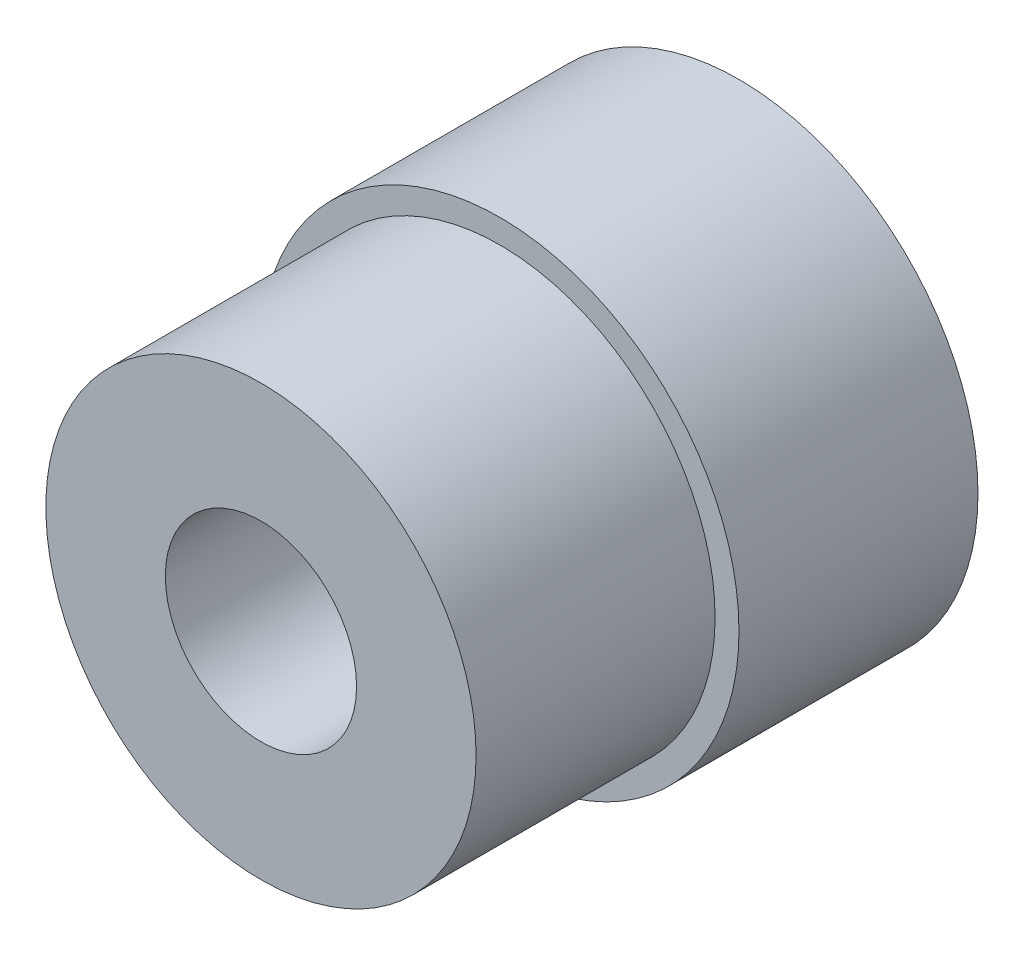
ISO-10303-21;
HEADER;
FILE_DESCRIPTION(('STEP AP214'),'2;1');
FILE_NAME('part.step','',(''),(''),'','','');
FILE_SCHEMA(('AUTOMOTIVE_DESIGN { 1 0 10303 214 1 1 1 1 }'));
ENDSEC;
DATA;
#1=APPLICATION_CONTEXT('core data for automotive mechanical design processes');
#2=APPLICATION_PROTOCOL_DEFINITION('international standard','automotive_design',2000,#1);
#3=PRODUCT_CONTEXT('',#1,'mechanical');
#4=PRODUCT('Part','Part','',(#3));
#5=PRODUCT_RELATED_PRODUCT_CATEGORY('part','',(#4));
#6=PRODUCT_DEFINITION_FORMATION('','',#4);
#7=PRODUCT_DEFINITION_CONTEXT('part definition',#1,'design');
#8=PRODUCT_DEFINITION('design','',#6,#7);
#9=PRODUCT_DEFINITION_SHAPE('','',#8);
#10=(LENGTH_UNIT() NAMED_UNIT(*) SI_UNIT(.MILLI.,.METRE.));
#11=(NAMED_UNIT(*) PLANE_ANGLE_UNIT() SI_UNIT($,.RADIAN.));
#12=(NAMED_UNIT(*) SI_UNIT($,.STERADIAN.) SOLID_ANGLE_UNIT());
#13=UNCERTAINTY_MEASURE_WITH_UNIT(LENGTH_MEASURE(1.E-05),#10,'distance_accuracy_value','');
#14=(GEOMETRIC_REPRESENTATION_CONTEXT(3) GLOBAL_UNCERTAINTY_ASSIGNED_CONTEXT((#13)) GLOBAL_UNIT_ASSIGNED_CONTEXT((#10,
#11,#12)) REPRESENTATION_CONTEXT('',''));
#15=CARTESIAN_POINT('',(0.,0.,0.));
#16=DIRECTION('',(0.,0.,1.));
#17=DIRECTION('',(1.,0.,0.));
#18=AXIS2_PLACEMENT_3D('',#15,#16,#17);
#19=CARTESIAN_POINT('',(0.,0.,10.));
#20=DIRECTION('',(0.,0.,-1.));
#21=DIRECTION('',(-1.,0.,0.));
#22=AXIS2_PLACEMENT_3D('',#19,#20,#21);
#23=CYLINDRICAL_SURFACE('',#22,10.);
#24=CARTESIAN_POINT('',(0.,0.,10.));
#25=DIRECTION('',(0.,0.,1.));
#26=DIRECTION('',(1.,0.,0.));
#27=AXIS2_PLACEMENT_3D('',#24,#25,#26);
#28=CIRCLE('',#27,10.);
#29=CARTESIAN_POINT('',(10.,0.,10.));
#30=VERTEX_POINT('',#29);
#31=EDGE_CURVE('E44',#30,#30,#28,.T.);
#32=ORIENTED_EDGE('',*,*,#31,.F.);
#33=EDGE_LOOP('',(#32));
#34=FACE_BOUND('',#33,.T.);
#35=CARTESIAN_POINT('',(0.,0.,0.));
#36=DIRECTION('',(0.,0.,1.));
#37=DIRECTION('',(1.,0.,0.));
#38=AXIS2_PLACEMENT_3D('',#35,#36,#37);
#39=CIRCLE('',#38,10.);
#40=CARTESIAN_POINT('',(10.,0.,0.));
#41=VERTEX_POINT('',#40);
#42=EDGE_CURVE('E49',#41,#41,#39,.T.);
#43=ORIENTED_EDGE('',*,*,#42,.T.);
#44=EDGE_LOOP('',(#43));
#45=FACE_BOUND('',#44,.T.);
#46=ADVANCED_FACE('F37',(#34,#45),#23,.T.);
#47=CARTESIAN_POINT('',(0.,0.,10.));
#48=DIRECTION('',(0.,0.,1.));
#49=DIRECTION('',(1.,0.,0.));
#50=AXIS2_PLACEMENT_3D('',#47,#48,#49);
#51=PLANE('',#50);
#52=CARTESIAN_POINT('',(0.,0.,10.));
#53=DIRECTION('',(0.,0.,1.));
#54=DIRECTION('',(1.,0.,0.));
#55=AXIS2_PLACEMENT_3D('',#52,#53,#54);
#56=CIRCLE('',#55,9.);
#57=CARTESIAN_POINT('',(9.,0.,10.));
#58=VERTEX_POINT('',#57);
#59=EDGE_CURVE('E57',#58,#58,#56,.T.);
#60=ORIENTED_EDGE('',*,*,#59,.F.);
#61=EDGE_LOOP('',(#60));
#62=FACE_BOUND('',#61,.T.);
#63=ORIENTED_EDGE('',*,*,#31,.T.);
#64=EDGE_LOOP('',(#63));
#65=FACE_BOUND('',#64,.T.);
#66=ADVANCED_FACE('F83',(#62,#65),#51,.T.);
#67=CARTESIAN_POINT('',(0.,0.,0.));
#68=DIRECTION('',(0.,0.,1.));
#69=DIRECTION('',(1.,0.,0.));
#70=AXIS2_PLACEMENT_3D('',#67,#68,#69);
#71=PLANE('',#70);
#72=ORIENTED_EDGE('',*,*,#42,.F.);
#73=EDGE_LOOP('',(#72));
#74=FACE_BOUND('',#73,.T.);
#75=ADVANCED_FACE('F74',(#74),#71,.F.);
#76=CARTESIAN_POINT('',(0.,0.,20.));
#77=DIRECTION('',(0.,0.,1.));
#78=DIRECTION('',(1.,0.,0.));
#79=AXIS2_PLACEMENT_3D('',#76,#77,#78);
#80=PLANE('',#79);
#81=CARTESIAN_POINT('',(0.,0.,20.));
#82=DIRECTION('',(0.,0.,1.));
#83=DIRECTION('',(1.,0.,0.));
#84=AXIS2_PLACEMENT_3D('',#81,#82,#83);
#85=CIRCLE('',#84,9.);
#86=CARTESIAN_POINT('',(9.,0.,20.));
#87=VERTEX_POINT('',#86);
#88=EDGE_CURVE('E55',#87,#87,#85,.T.);
#89=ORIENTED_EDGE('',*,*,#88,.T.);
#90=EDGE_LOOP('',(#89));
#91=FACE_BOUND('',#90,.T.);
#92=CARTESIAN_POINT('',(0.,0.,20.));
#93=DIRECTION('',(0.,0.,1.));
#94=DIRECTION('',(1.,0.,0.));
#95=AXIS2_PLACEMENT_3D('',#92,#93,#94);
#96=CIRCLE('',#95,4.);
#97=CARTESIAN_POINT('',(4.,0.,20.));
#98=VERTEX_POINT('',#97);
#99=EDGE_CURVE('E61',#98,#98,#96,.T.);
#100=ORIENTED_EDGE('',*,*,#99,.F.);
#101=EDGE_LOOP('',(#100));
#102=FACE_BOUND('',#101,.T.);
#103=ADVANCED_FACE('F71',(#91,#102),#80,.T.);
#104=CARTESIAN_POINT('',(0.,0.,20.));
#105=DIRECTION('',(0.,0.,-1.));
#106=DIRECTION('',(-1.,0.,0.));
#107=AXIS2_PLACEMENT_3D('',#104,#105,#106);
#108=CYLINDRICAL_SURFACE('',#107,9.);
#109=ORIENTED_EDGE('',*,*,#88,.F.);
#110=EDGE_LOOP('',(#109));
#111=FACE_BOUND('',#110,.T.);
#112=ORIENTED_EDGE('',*,*,#59,.T.);
#113=EDGE_LOOP('',(#112));
#114=FACE_BOUND('',#113,.T.);
#115=ADVANCED_FACE('F73',(#111,#114),#108,.T.);
#116=CARTESIAN_POINT('',(0.,0.,20.));
#117=DIRECTION('',(0.,0.,-1.));
#118=DIRECTION('',(-1.,0.,0.));
#119=AXIS2_PLACEMENT_3D('',#116,#117,#118);
#120=CYLINDRICAL_SURFACE('',#119,4.);
#121=ORIENTED_EDGE('',*,*,#99,.T.);
#122=EDGE_LOOP('',(#121));
#123=FACE_BOUND('',#122,.T.);
#124=CARTESIAN_POINT('',(0.,0.,10.));
#125=DIRECTION('',(0.,0.,1.));
#126=DIRECTION('',(1.,0.,0.));
#127=AXIS2_PLACEMENT_3D('',#124,#125,#126);
#128=CIRCLE('',#127,4.);
#129=CARTESIAN_POINT('',(4.,0.,10.));
#130=VERTEX_POINT('',#129);
#131=EDGE_CURVE('E10',#130,#130,#128,.F.);
#132=ORIENTED_EDGE('',*,*,#131,.T.);
#133=EDGE_LOOP('',(#132));
#134=FACE_BOUND('',#133,.T.);
#135=ADVANCED_FACE('F69',(#123,#134),#120,.F.);
#136=ORIENTED_EDGE('',*,*,#131,.F.);
#137=EDGE_LOOP('',(#136));
#138=FACE_BOUND('',#137,.T.);
#139=ADVANCED_FACE('F93',(#138),#51,.T.);
#140=CLOSED_SHELL('',(#46,#66,#75,#103,#115,#135,#139));
#141=MANIFOLD_SOLID_BREP('B2',#140);
#142=ADVANCED_BREP_SHAPE_REPRESENTATION('',(#18,#141),#14);
#143=SHAPE_DEFINITION_REPRESENTATION(#9,#142);
ENDSEC;
END-ISO-10303-21;
